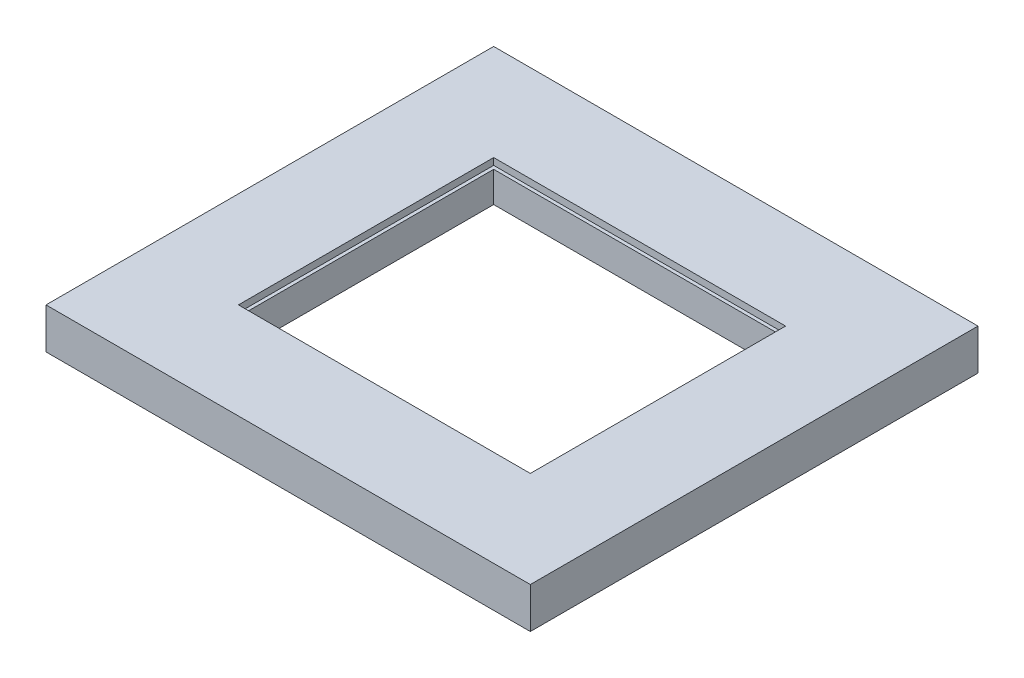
ISO-10303-21;
HEADER;
FILE_DESCRIPTION(('STEP AP214'),'2;1');
FILE_NAME('part.step','',(''),(''),'','','');
FILE_SCHEMA(('AUTOMOTIVE_DESIGN { 1 0 10303 214 1 1 1 1 }'));
ENDSEC;
DATA;
#1=APPLICATION_CONTEXT('core data for automotive mechanical design processes');
#2=APPLICATION_PROTOCOL_DEFINITION('international standard','automotive_design',2000,#1);
#3=PRODUCT_CONTEXT('',#1,'mechanical');
#4=PRODUCT('Part','Part','',(#3));
#5=PRODUCT_RELATED_PRODUCT_CATEGORY('part','',(#4));
#6=PRODUCT_DEFINITION_FORMATION('','',#4);
#7=PRODUCT_DEFINITION_CONTEXT('part definition',#1,'design');
#8=PRODUCT_DEFINITION('design','',#6,#7);
#9=PRODUCT_DEFINITION_SHAPE('','',#8);
#10=(LENGTH_UNIT() NAMED_UNIT(*) SI_UNIT(.MILLI.,.METRE.));
#11=(NAMED_UNIT(*) PLANE_ANGLE_UNIT() SI_UNIT($,.RADIAN.));
#12=(NAMED_UNIT(*) SI_UNIT($,.STERADIAN.) SOLID_ANGLE_UNIT());
#13=UNCERTAINTY_MEASURE_WITH_UNIT(LENGTH_MEASURE(1.E-05),#10,'distance_accuracy_value','');
#14=(GEOMETRIC_REPRESENTATION_CONTEXT(3) GLOBAL_UNCERTAINTY_ASSIGNED_CONTEXT((#13)) GLOBAL_UNIT_ASSIGNED_CONTEXT((#10,
#11,#12)) REPRESENTATION_CONTEXT('',''));
#15=CARTESIAN_POINT('',(0.,0.,0.));
#16=DIRECTION('',(0.,0.,1.));
#17=DIRECTION('',(1.,0.,0.));
#18=AXIS2_PLACEMENT_3D('',#15,#16,#17);
#19=CARTESIAN_POINT('',(0.,7.145,0.));
#20=DIRECTION('',(0.,1.,0.));
#21=DIRECTION('',(0.,0.,1.));
#22=AXIS2_PLACEMENT_3D('',#19,#20,#21);
#23=PLANE('',#22);
#24=DIRECTION('',(-1.,0.,0.));
#25=VECTOR('',#24,1.);
#26=CARTESIAN_POINT('',(-68.2650000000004,7.145,-59.6900000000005));
#27=LINE('',#26,#25);
#28=CARTESIAN_POINT('',(68.2649999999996,7.145,-59.6900000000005));
#29=VERTEX_POINT('',#28);
#30=CARTESIAN_POINT('',(-68.2650000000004,7.145,-59.6900000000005));
#31=VERTEX_POINT('',#30);
#32=EDGE_CURVE('E238',#29,#31,#27,.T.);
#33=ORIENTED_EDGE('',*,*,#32,.F.);
#34=DIRECTION('',(0.,0.,-1.));
#35=VECTOR('',#34,1.);
#36=CARTESIAN_POINT('',(68.2649999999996,7.145,-59.6900000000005));
#37=LINE('',#36,#35);
#38=CARTESIAN_POINT('',(68.2649999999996,7.145,59.6899999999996));
#39=VERTEX_POINT('',#38);
#40=EDGE_CURVE('E236',#39,#29,#37,.T.);
#41=ORIENTED_EDGE('',*,*,#40,.F.);
#42=DIRECTION('',(1.,0.,0.));
#43=VECTOR('',#42,1.);
#44=CARTESIAN_POINT('',(-68.2650000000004,7.145,59.6899999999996));
#45=LINE('',#44,#43);
#46=CARTESIAN_POINT('',(-68.2650000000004,7.145,59.6899999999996));
#47=VERTEX_POINT('',#46);
#48=EDGE_CURVE('E243',#47,#39,#45,.T.);
#49=ORIENTED_EDGE('',*,*,#48,.F.);
#50=DIRECTION('',(0.,0.,1.));
#51=VECTOR('',#50,1.);
#52=CARTESIAN_POINT('',(-68.2650000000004,7.145,-59.6900000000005));
#53=LINE('',#52,#51);
#54=EDGE_CURVE('E241',#31,#47,#53,.T.);
#55=ORIENTED_EDGE('',*,*,#54,.F.);
#56=EDGE_LOOP('',(#33,#41,#49,#55));
#57=FACE_BOUND('',#56,.T.);
#58=DIRECTION('',(1.,0.,0.));
#59=VECTOR('',#58,1.);
#60=CARTESIAN_POINT('',(93.6649999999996,7.145,85.0899999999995));
#61=LINE('',#60,#59);
#62=CARTESIAN_POINT('',(-93.6650000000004,7.145,85.0899999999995));
#63=VERTEX_POINT('',#62);
#64=CARTESIAN_POINT('',(93.6649999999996,7.145,85.0899999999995));
#65=VERTEX_POINT('',#64);
#66=EDGE_CURVE('E209',#63,#65,#61,.T.);
#67=ORIENTED_EDGE('',*,*,#66,.T.);
#68=DIRECTION('',(0.,0.,-1.));
#69=VECTOR('',#68,1.);
#70=CARTESIAN_POINT('',(93.6649999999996,7.145,85.0899999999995));
#71=LINE('',#70,#69);
#72=CARTESIAN_POINT('',(93.6649999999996,7.145,-85.0900000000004));
#73=VERTEX_POINT('',#72);
#74=EDGE_CURVE('E204',#65,#73,#71,.T.);
#75=ORIENTED_EDGE('',*,*,#74,.T.);
#76=DIRECTION('',(-1.,0.,0.));
#77=VECTOR('',#76,1.);
#78=CARTESIAN_POINT('',(93.6649999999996,7.145,-85.0900000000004));
#79=LINE('',#78,#77);
#80=CARTESIAN_POINT('',(-93.6650000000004,7.145,-85.0900000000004));
#81=VERTEX_POINT('',#80);
#82=EDGE_CURVE('E219',#73,#81,#79,.T.);
#83=ORIENTED_EDGE('',*,*,#82,.T.);
#84=DIRECTION('',(0.,0.,1.));
#85=VECTOR('',#84,1.);
#86=CARTESIAN_POINT('',(-93.6650000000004,7.145,85.0899999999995));
#87=LINE('',#86,#85);
#88=EDGE_CURVE('E222',#81,#63,#87,.T.);
#89=ORIENTED_EDGE('',*,*,#88,.T.);
#90=EDGE_LOOP('',(#67,#75,#83,#89));
#91=FACE_BOUND('',#90,.T.);
#92=ADVANCED_FACE('F35',(#57,#91),#23,.T.);
#93=CARTESIAN_POINT('',(0.,-7.145,0.));
#94=DIRECTION('',(0.,1.,0.));
#95=DIRECTION('',(0.,0.,1.));
#96=AXIS2_PLACEMENT_3D('',#93,#94,#95);
#97=PLANE('',#96);
#98=DIRECTION('',(0.,0.,-1.));
#99=VECTOR('',#98,1.);
#100=CARTESIAN_POINT('',(113.265,-7.145,-104.69));
#101=LINE('',#100,#99);
#102=CARTESIAN_POINT('',(113.265,-7.145,104.69));
#103=VERTEX_POINT('',#102);
#104=CARTESIAN_POINT('',(113.265,-7.145,-104.69));
#105=VERTEX_POINT('',#104);
#106=EDGE_CURVE('E264',#103,#105,#101,.T.);
#107=ORIENTED_EDGE('',*,*,#106,.F.);
#108=DIRECTION('',(1.,0.,0.));
#109=VECTOR('',#108,1.);
#110=CARTESIAN_POINT('',(-113.265,-7.145,104.69));
#111=LINE('',#110,#109);
#112=CARTESIAN_POINT('',(-113.265,-7.145,104.69));
#113=VERTEX_POINT('',#112);
#114=EDGE_CURVE('E271',#113,#103,#111,.T.);
#115=ORIENTED_EDGE('',*,*,#114,.F.);
#116=DIRECTION('',(0.,0.,1.));
#117=VECTOR('',#116,1.);
#118=CARTESIAN_POINT('',(-113.265,-7.145,-104.69));
#119=LINE('',#118,#117);
#120=CARTESIAN_POINT('',(-113.265,-7.145,-104.69));
#121=VERTEX_POINT('',#120);
#122=EDGE_CURVE('E269',#121,#113,#119,.T.);
#123=ORIENTED_EDGE('',*,*,#122,.F.);
#124=DIRECTION('',(-1.,0.,0.));
#125=VECTOR('',#124,1.);
#126=CARTESIAN_POINT('',(-113.265,-7.145,-104.69));
#127=LINE('',#126,#125);
#128=EDGE_CURVE('E267',#105,#121,#127,.T.);
#129=ORIENTED_EDGE('',*,*,#128,.F.);
#130=EDGE_LOOP('',(#107,#115,#123,#129));
#131=FACE_BOUND('',#130,.T.);
#132=DIRECTION('',(0.,0.,-1.));
#133=VECTOR('',#132,1.);
#134=CARTESIAN_POINT('',(68.2649999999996,-7.145,-59.6900000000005));
#135=LINE('',#134,#133);
#136=CARTESIAN_POINT('',(68.2649999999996,-7.145,59.6899999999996));
#137=VERTEX_POINT('',#136);
#138=CARTESIAN_POINT('',(68.2649999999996,-7.145,-59.6900000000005));
#139=VERTEX_POINT('',#138);
#140=EDGE_CURVE('E235',#137,#139,#135,.T.);
#141=ORIENTED_EDGE('',*,*,#140,.T.);
#142=DIRECTION('',(-1.,0.,0.));
#143=VECTOR('',#142,1.);
#144=CARTESIAN_POINT('',(-68.2650000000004,-7.145,-59.6900000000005));
#145=LINE('',#144,#143);
#146=CARTESIAN_POINT('',(-68.2650000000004,-7.145,-59.6900000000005));
#147=VERTEX_POINT('',#146);
#148=EDGE_CURVE('E248',#139,#147,#145,.T.);
#149=ORIENTED_EDGE('',*,*,#148,.T.);
#150=DIRECTION('',(0.,0.,1.));
#151=VECTOR('',#150,1.);
#152=CARTESIAN_POINT('',(-68.2650000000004,-7.145,-59.6900000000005));
#153=LINE('',#152,#151);
#154=CARTESIAN_POINT('',(-68.2650000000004,-7.145,59.6899999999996));
#155=VERTEX_POINT('',#154);
#156=EDGE_CURVE('E251',#147,#155,#153,.T.);
#157=ORIENTED_EDGE('',*,*,#156,.T.);
#158=DIRECTION('',(1.,0.,0.));
#159=VECTOR('',#158,1.);
#160=CARTESIAN_POINT('',(-68.2650000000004,-7.145,59.6899999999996));
#161=LINE('',#160,#159);
#162=EDGE_CURVE('E239',#155,#137,#161,.T.);
#163=ORIENTED_EDGE('',*,*,#162,.T.);
#164=EDGE_LOOP('',(#141,#149,#157,#163));
#165=FACE_BOUND('',#164,.T.);
#166=ADVANCED_FACE('F288',(#131,#165),#97,.F.);
#167=CARTESIAN_POINT('',(113.265,7.145,-104.69));
#168=DIRECTION('',(-1.,0.,0.));
#169=DIRECTION('',(0.,0.,1.));
#170=AXIS2_PLACEMENT_3D('',#167,#168,#169);
#171=PLANE('',#170);
#172=ORIENTED_EDGE('',*,*,#106,.T.);
#173=DIRECTION('',(0.,-1.,0.));
#174=VECTOR('',#173,1.);
#175=CARTESIAN_POINT('',(113.265,7.145,-104.69));
#176=LINE('',#175,#174);
#177=CARTESIAN_POINT('',(113.265,11.905,-104.69));
#178=VERTEX_POINT('',#177);
#179=EDGE_CURVE('E11',#178,#105,#176,.T.);
#180=ORIENTED_EDGE('',*,*,#179,.F.);
#181=DIRECTION('',(0.,0.,-1.));
#182=VECTOR('',#181,1.);
#183=CARTESIAN_POINT('',(113.265,11.905,104.69));
#184=LINE('',#183,#182);
#185=CARTESIAN_POINT('',(113.265,11.905,104.69));
#186=VERTEX_POINT('',#185);
#187=EDGE_CURVE('E198',#186,#178,#184,.T.);
#188=ORIENTED_EDGE('',*,*,#187,.F.);
#189=DIRECTION('',(0.,-1.,0.));
#190=VECTOR('',#189,1.);
#191=CARTESIAN_POINT('',(113.265,7.145,104.69));
#192=LINE('',#191,#190);
#193=EDGE_CURVE('E273',#186,#103,#192,.T.);
#194=ORIENTED_EDGE('',*,*,#193,.T.);
#195=EDGE_LOOP('',(#172,#180,#188,#194));
#196=FACE_BOUND('',#195,.T.);
#197=ADVANCED_FACE('F37',(#196),#171,.F.);
#198=CARTESIAN_POINT('',(-113.265,7.145,-104.69));
#199=DIRECTION('',(0.,0.,1.));
#200=DIRECTION('',(1.,0.,0.));
#201=AXIS2_PLACEMENT_3D('',#198,#199,#200);
#202=PLANE('',#201);
#203=ORIENTED_EDGE('',*,*,#128,.T.);
#204=DIRECTION('',(0.,-1.,0.));
#205=VECTOR('',#204,1.);
#206=CARTESIAN_POINT('',(-113.265,7.145,-104.69));
#207=LINE('',#206,#205);
#208=CARTESIAN_POINT('',(-113.265,11.905,-104.69));
#209=VERTEX_POINT('',#208);
#210=EDGE_CURVE('E43',#209,#121,#207,.T.);
#211=ORIENTED_EDGE('',*,*,#210,.F.);
#212=DIRECTION('',(-1.,0.,0.));
#213=VECTOR('',#212,1.);
#214=CARTESIAN_POINT('',(113.265,11.905,-104.69));
#215=LINE('',#214,#213);
#216=EDGE_CURVE('E201',#178,#209,#215,.T.);
#217=ORIENTED_EDGE('',*,*,#216,.F.);
#218=ORIENTED_EDGE('',*,*,#179,.T.);
#219=EDGE_LOOP('',(#203,#211,#217,#218));
#220=FACE_BOUND('',#219,.T.);
#221=ADVANCED_FACE('F296',(#220),#202,.F.);
#222=CARTESIAN_POINT('',(-113.265,7.145,-104.69));
#223=DIRECTION('',(1.,0.,0.));
#224=DIRECTION('',(0.,0.,-1.));
#225=AXIS2_PLACEMENT_3D('',#222,#223,#224);
#226=PLANE('',#225);
#227=ORIENTED_EDGE('',*,*,#122,.T.);
#228=DIRECTION('',(0.,-1.,0.));
#229=VECTOR('',#228,1.);
#230=CARTESIAN_POINT('',(-113.265,7.145,104.69));
#231=LINE('',#230,#229);
#232=CARTESIAN_POINT('',(-113.265,11.905,104.69));
#233=VERTEX_POINT('',#232);
#234=EDGE_CURVE('E276',#233,#113,#231,.T.);
#235=ORIENTED_EDGE('',*,*,#234,.F.);
#236=DIRECTION('',(0.,0.,1.));
#237=VECTOR('',#236,1.);
#238=CARTESIAN_POINT('',(-113.265,11.905,-104.69));
#239=LINE('',#238,#237);
#240=EDGE_CURVE('E169',#209,#233,#239,.T.);
#241=ORIENTED_EDGE('',*,*,#240,.F.);
#242=ORIENTED_EDGE('',*,*,#210,.T.);
#243=EDGE_LOOP('',(#227,#235,#241,#242));
#244=FACE_BOUND('',#243,.T.);
#245=ADVANCED_FACE('F282',(#244),#226,.F.);
#246=CARTESIAN_POINT('',(-113.265,7.145,104.69));
#247=DIRECTION('',(0.,0.,-1.));
#248=DIRECTION('',(-1.,0.,0.));
#249=AXIS2_PLACEMENT_3D('',#246,#247,#248);
#250=PLANE('',#249);
#251=ORIENTED_EDGE('',*,*,#114,.T.);
#252=ORIENTED_EDGE('',*,*,#193,.F.);
#253=DIRECTION('',(1.,0.,0.));
#254=VECTOR('',#253,1.);
#255=CARTESIAN_POINT('',(-113.265,11.905,104.69));
#256=LINE('',#255,#254);
#257=EDGE_CURVE('E195',#233,#186,#256,.T.);
#258=ORIENTED_EDGE('',*,*,#257,.F.);
#259=ORIENTED_EDGE('',*,*,#234,.T.);
#260=EDGE_LOOP('',(#251,#252,#258,#259));
#261=FACE_BOUND('',#260,.T.);
#262=ADVANCED_FACE('F291',(#261),#250,.F.);
#263=CARTESIAN_POINT('',(68.2649999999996,7.145,-59.6900000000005));
#264=DIRECTION('',(-1.,0.,0.));
#265=DIRECTION('',(0.,0.,1.));
#266=AXIS2_PLACEMENT_3D('',#263,#264,#265);
#267=PLANE('',#266);
#268=ORIENTED_EDGE('',*,*,#140,.F.);
#269=DIRECTION('',(0.,-1.,0.));
#270=VECTOR('',#269,1.);
#271=CARTESIAN_POINT('',(68.2649999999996,7.145,59.6899999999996));
#272=LINE('',#271,#270);
#273=EDGE_CURVE('E245',#39,#137,#272,.T.);
#274=ORIENTED_EDGE('',*,*,#273,.F.);
#275=ORIENTED_EDGE('',*,*,#40,.T.);
#276=DIRECTION('',(0.,-1.,0.));
#277=VECTOR('',#276,1.);
#278=CARTESIAN_POINT('',(68.2649999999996,7.145,-59.6900000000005));
#279=LINE('',#278,#277);
#280=EDGE_CURVE('E261',#29,#139,#279,.T.);
#281=ORIENTED_EDGE('',*,*,#280,.T.);
#282=EDGE_LOOP('',(#268,#274,#275,#281));
#283=FACE_BOUND('',#282,.T.);
#284=ADVANCED_FACE('F315',(#283),#267,.T.);
#285=CARTESIAN_POINT('',(-68.2650000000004,7.145,-59.6900000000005));
#286=DIRECTION('',(0.,0.,1.));
#287=DIRECTION('',(1.,0.,0.));
#288=AXIS2_PLACEMENT_3D('',#285,#286,#287);
#289=PLANE('',#288);
#290=ORIENTED_EDGE('',*,*,#148,.F.);
#291=ORIENTED_EDGE('',*,*,#280,.F.);
#292=ORIENTED_EDGE('',*,*,#32,.T.);
#293=DIRECTION('',(0.,-1.,0.));
#294=VECTOR('',#293,1.);
#295=CARTESIAN_POINT('',(-68.2650000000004,7.145,-59.6900000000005));
#296=LINE('',#295,#294);
#297=EDGE_CURVE('E259',#31,#147,#296,.T.);
#298=ORIENTED_EDGE('',*,*,#297,.T.);
#299=EDGE_LOOP('',(#290,#291,#292,#298));
#300=FACE_BOUND('',#299,.T.);
#301=ADVANCED_FACE('F323',(#300),#289,.T.);
#302=CARTESIAN_POINT('',(-68.2650000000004,7.145,-59.6900000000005));
#303=DIRECTION('',(1.,0.,0.));
#304=DIRECTION('',(0.,0.,-1.));
#305=AXIS2_PLACEMENT_3D('',#302,#303,#304);
#306=PLANE('',#305);
#307=ORIENTED_EDGE('',*,*,#156,.F.);
#308=ORIENTED_EDGE('',*,*,#297,.F.);
#309=ORIENTED_EDGE('',*,*,#54,.T.);
#310=DIRECTION('',(0.,-1.,0.));
#311=VECTOR('',#310,1.);
#312=CARTESIAN_POINT('',(-68.2650000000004,7.145,59.6899999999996));
#313=LINE('',#312,#311);
#314=EDGE_CURVE('E58',#47,#155,#313,.T.);
#315=ORIENTED_EDGE('',*,*,#314,.T.);
#316=EDGE_LOOP('',(#307,#308,#309,#315));
#317=FACE_BOUND('',#316,.T.);
#318=ADVANCED_FACE('F328',(#317),#306,.T.);
#319=CARTESIAN_POINT('',(-68.2650000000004,7.145,59.6899999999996));
#320=DIRECTION('',(0.,0.,-1.));
#321=DIRECTION('',(-1.,0.,0.));
#322=AXIS2_PLACEMENT_3D('',#319,#320,#321);
#323=PLANE('',#322);
#324=ORIENTED_EDGE('',*,*,#162,.F.);
#325=ORIENTED_EDGE('',*,*,#314,.F.);
#326=ORIENTED_EDGE('',*,*,#48,.T.);
#327=ORIENTED_EDGE('',*,*,#273,.T.);
#328=EDGE_LOOP('',(#324,#325,#326,#327));
#329=FACE_BOUND('',#328,.T.);
#330=ADVANCED_FACE('F333',(#329),#323,.T.);
#331=CARTESIAN_POINT('',(93.6649999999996,8.735,85.0899999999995));
#332=DIRECTION('',(-1.,0.,0.));
#333=DIRECTION('',(0.,0.,1.));
#334=AXIS2_PLACEMENT_3D('',#331,#332,#333);
#335=PLANE('',#334);
#336=ORIENTED_EDGE('',*,*,#74,.F.);
#337=DIRECTION('',(0.,-1.,0.));
#338=VECTOR('',#337,1.);
#339=CARTESIAN_POINT('',(93.6649999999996,8.735,85.0899999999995));
#340=LINE('',#339,#338);
#341=CARTESIAN_POINT('',(93.6649999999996,8.735,85.0899999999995));
#342=VERTEX_POINT('',#341);
#343=EDGE_CURVE('E50',#342,#65,#340,.T.);
#344=ORIENTED_EDGE('',*,*,#343,.F.);
#345=DIRECTION('',(0.,0.,-1.));
#346=VECTOR('',#345,1.);
#347=CARTESIAN_POINT('',(93.6649999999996,8.735,85.0899999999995));
#348=LINE('',#347,#346);
#349=CARTESIAN_POINT('',(93.6649999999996,8.735,-85.0900000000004));
#350=VERTEX_POINT('',#349);
#351=EDGE_CURVE('E205',#342,#350,#348,.T.);
#352=ORIENTED_EDGE('',*,*,#351,.T.);
#353=DIRECTION('',(0.,-1.,0.));
#354=VECTOR('',#353,1.);
#355=CARTESIAN_POINT('',(93.6649999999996,8.735,-85.0900000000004));
#356=LINE('',#355,#354);
#357=EDGE_CURVE('E232',#350,#73,#356,.T.);
#358=ORIENTED_EDGE('',*,*,#357,.T.);
#359=EDGE_LOOP('',(#336,#344,#352,#358));
#360=FACE_BOUND('',#359,.T.);
#361=ADVANCED_FACE('F344',(#360),#335,.T.);
#362=CARTESIAN_POINT('',(93.6649999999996,8.735,-85.0900000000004));
#363=DIRECTION('',(0.,0.,1.));
#364=DIRECTION('',(1.,0.,0.));
#365=AXIS2_PLACEMENT_3D('',#362,#363,#364);
#366=PLANE('',#365);
#367=ORIENTED_EDGE('',*,*,#82,.F.);
#368=ORIENTED_EDGE('',*,*,#357,.F.);
#369=DIRECTION('',(-1.,0.,0.));
#370=VECTOR('',#369,1.);
#371=CARTESIAN_POINT('',(93.6649999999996,8.735,-85.0900000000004));
#372=LINE('',#371,#370);
#373=CARTESIAN_POINT('',(-93.6650000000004,8.735,-85.0900000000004));
#374=VERTEX_POINT('',#373);
#375=EDGE_CURVE('E208',#350,#374,#372,.T.);
#376=ORIENTED_EDGE('',*,*,#375,.T.);
#377=DIRECTION('',(0.,-1.,0.));
#378=VECTOR('',#377,1.);
#379=CARTESIAN_POINT('',(-93.6650000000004,8.735,-85.0900000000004));
#380=LINE('',#379,#378);
#381=EDGE_CURVE('E230',#374,#81,#380,.T.);
#382=ORIENTED_EDGE('',*,*,#381,.T.);
#383=EDGE_LOOP('',(#367,#368,#376,#382));
#384=FACE_BOUND('',#383,.T.);
#385=ADVANCED_FACE('F348',(#384),#366,.T.);
#386=CARTESIAN_POINT('',(-93.6650000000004,8.735,85.0899999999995));
#387=DIRECTION('',(1.,0.,0.));
#388=DIRECTION('',(0.,0.,-1.));
#389=AXIS2_PLACEMENT_3D('',#386,#387,#388);
#390=PLANE('',#389);
#391=ORIENTED_EDGE('',*,*,#88,.F.);
#392=ORIENTED_EDGE('',*,*,#381,.F.);
#393=DIRECTION('',(0.,0.,1.));
#394=VECTOR('',#393,1.);
#395=CARTESIAN_POINT('',(-93.6650000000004,8.735,85.0899999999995));
#396=LINE('',#395,#394);
#397=CARTESIAN_POINT('',(-93.6650000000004,8.735,85.0899999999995));
#398=VERTEX_POINT('',#397);
#399=EDGE_CURVE('E212',#374,#398,#396,.T.);
#400=ORIENTED_EDGE('',*,*,#399,.T.);
#401=DIRECTION('',(0.,-1.,0.));
#402=VECTOR('',#401,1.);
#403=CARTESIAN_POINT('',(-93.6650000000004,8.735,85.0899999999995));
#404=LINE('',#403,#402);
#405=EDGE_CURVE('E228',#398,#63,#404,.T.);
#406=ORIENTED_EDGE('',*,*,#405,.T.);
#407=EDGE_LOOP('',(#391,#392,#400,#406));
#408=FACE_BOUND('',#407,.T.);
#409=ADVANCED_FACE('F352',(#408),#390,.T.);
#410=CARTESIAN_POINT('',(93.6649999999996,8.735,85.0899999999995));
#411=DIRECTION('',(0.,0.,-1.));
#412=DIRECTION('',(-1.,0.,0.));
#413=AXIS2_PLACEMENT_3D('',#410,#411,#412);
#414=PLANE('',#413);
#415=ORIENTED_EDGE('',*,*,#66,.F.);
#416=ORIENTED_EDGE('',*,*,#405,.F.);
#417=DIRECTION('',(1.,0.,0.));
#418=VECTOR('',#417,1.);
#419=CARTESIAN_POINT('',(93.6649999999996,8.735,85.0899999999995));
#420=LINE('',#419,#418);
#421=EDGE_CURVE('E215',#398,#342,#420,.T.);
#422=ORIENTED_EDGE('',*,*,#421,.T.);
#423=ORIENTED_EDGE('',*,*,#343,.T.);
#424=EDGE_LOOP('',(#415,#416,#422,#423));
#425=FACE_BOUND('',#424,.T.);
#426=ADVANCED_FACE('F356',(#425),#414,.T.);
#427=CARTESIAN_POINT('',(0.,11.905,0.));
#428=DIRECTION('',(0.,1.,0.));
#429=DIRECTION('',(0.,0.,1.));
#430=AXIS2_PLACEMENT_3D('',#427,#428,#429);
#431=PLANE('',#430);
#432=ORIENTED_EDGE('',*,*,#240,.T.);
#433=ORIENTED_EDGE('',*,*,#257,.T.);
#434=ORIENTED_EDGE('',*,*,#187,.T.);
#435=ORIENTED_EDGE('',*,*,#216,.T.);
#436=EDGE_LOOP('',(#432,#433,#434,#435));
#437=FACE_BOUND('',#436,.T.);
#438=DIRECTION('',(1.,0.,0.));
#439=VECTOR('',#438,1.);
#440=CARTESIAN_POINT('',(-68.2650000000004,11.905,59.6899999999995));
#441=LINE('',#440,#439);
#442=CARTESIAN_POINT('',(-68.2650000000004,11.905,59.6899999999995));
#443=VERTEX_POINT('',#442);
#444=CARTESIAN_POINT('',(68.2649999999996,11.905,59.6899999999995));
#445=VERTEX_POINT('',#444);
#446=EDGE_CURVE('E161',#443,#445,#441,.T.);
#447=ORIENTED_EDGE('',*,*,#446,.F.);
#448=DIRECTION('',(0.,0.,1.));
#449=VECTOR('',#448,1.);
#450=CARTESIAN_POINT('',(-68.2650000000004,11.905,-59.6900000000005));
#451=LINE('',#450,#449);
#452=CARTESIAN_POINT('',(-68.2650000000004,11.905,-59.6900000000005));
#453=VERTEX_POINT('',#452);
#454=EDGE_CURVE('E151',#453,#443,#451,.T.);
#455=ORIENTED_EDGE('',*,*,#454,.F.);
#456=DIRECTION('',(-1.,0.,0.));
#457=VECTOR('',#456,1.);
#458=CARTESIAN_POINT('',(68.2649999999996,11.905,-59.6900000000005));
#459=LINE('',#458,#457);
#460=CARTESIAN_POINT('',(68.2649999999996,11.905,-59.6900000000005));
#461=VERTEX_POINT('',#460);
#462=EDGE_CURVE('E177',#461,#453,#459,.T.);
#463=ORIENTED_EDGE('',*,*,#462,.F.);
#464=DIRECTION('',(0.,0.,-1.));
#465=VECTOR('',#464,1.);
#466=CARTESIAN_POINT('',(68.2649999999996,11.905,59.6899999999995));
#467=LINE('',#466,#465);
#468=EDGE_CURVE('E175',#445,#461,#467,.T.);
#469=ORIENTED_EDGE('',*,*,#468,.F.);
#470=EDGE_LOOP('',(#447,#455,#463,#469));
#471=FACE_BOUND('',#470,.T.);
#472=ADVANCED_FACE('F173',(#437,#471),#431,.T.);
#473=CARTESIAN_POINT('',(0.,8.735,0.));
#474=DIRECTION('',(0.,1.,0.));
#475=DIRECTION('',(0.,0.,1.));
#476=AXIS2_PLACEMENT_3D('',#473,#474,#475);
#477=PLANE('',#476);
#478=ORIENTED_EDGE('',*,*,#375,.F.);
#479=ORIENTED_EDGE('',*,*,#351,.F.);
#480=ORIENTED_EDGE('',*,*,#421,.F.);
#481=ORIENTED_EDGE('',*,*,#399,.F.);
#482=EDGE_LOOP('',(#478,#479,#480,#481));
#483=FACE_BOUND('',#482,.T.);
#484=DIRECTION('',(0.,0.,1.));
#485=VECTOR('',#484,1.);
#486=CARTESIAN_POINT('',(-68.2650000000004,8.735,-59.6900000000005));
#487=LINE('',#486,#485);
#488=CARTESIAN_POINT('',(-68.2650000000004,8.735,-59.6900000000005));
#489=VERTEX_POINT('',#488);
#490=CARTESIAN_POINT('',(-68.2650000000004,8.735,59.6899999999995));
#491=VERTEX_POINT('',#490);
#492=EDGE_CURVE('E181',#489,#491,#487,.T.);
#493=ORIENTED_EDGE('',*,*,#492,.T.);
#494=DIRECTION('',(1.,0.,0.));
#495=VECTOR('',#494,1.);
#496=CARTESIAN_POINT('',(-68.2650000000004,8.735,59.6899999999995));
#497=LINE('',#496,#495);
#498=CARTESIAN_POINT('',(68.2649999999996,8.735,59.6899999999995));
#499=VERTEX_POINT('',#498);
#500=EDGE_CURVE('E168',#491,#499,#497,.T.);
#501=ORIENTED_EDGE('',*,*,#500,.T.);
#502=DIRECTION('',(0.,0.,-1.));
#503=VECTOR('',#502,1.);
#504=CARTESIAN_POINT('',(68.2649999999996,8.735,59.6899999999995));
#505=LINE('',#504,#503);
#506=CARTESIAN_POINT('',(68.2649999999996,8.735,-59.6900000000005));
#507=VERTEX_POINT('',#506);
#508=EDGE_CURVE('E184',#499,#507,#505,.T.);
#509=ORIENTED_EDGE('',*,*,#508,.T.);
#510=DIRECTION('',(-1.,0.,0.));
#511=VECTOR('',#510,1.);
#512=CARTESIAN_POINT('',(68.2649999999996,8.735,-59.6900000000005));
#513=LINE('',#512,#511);
#514=EDGE_CURVE('E162',#507,#489,#513,.T.);
#515=ORIENTED_EDGE('',*,*,#514,.T.);
#516=EDGE_LOOP('',(#493,#501,#509,#515));
#517=FACE_BOUND('',#516,.T.);
#518=ADVANCED_FACE('F360',(#483,#517),#477,.F.);
#519=CARTESIAN_POINT('',(-68.2650000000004,11.905,-59.6900000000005));
#520=DIRECTION('',(1.,0.,0.));
#521=DIRECTION('',(0.,0.,-1.));
#522=AXIS2_PLACEMENT_3D('',#519,#520,#521);
#523=PLANE('',#522);
#524=ORIENTED_EDGE('',*,*,#492,.F.);
#525=DIRECTION('',(0.,-1.,0.));
#526=VECTOR('',#525,1.);
#527=CARTESIAN_POINT('',(-68.2650000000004,11.905,-59.6900000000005));
#528=LINE('',#527,#526);
#529=EDGE_CURVE('E157',#453,#489,#528,.T.);
#530=ORIENTED_EDGE('',*,*,#529,.F.);
#531=ORIENTED_EDGE('',*,*,#454,.T.);
#532=DIRECTION('',(0.,-1.,0.));
#533=VECTOR('',#532,1.);
#534=CARTESIAN_POINT('',(-68.2650000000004,11.905,59.6899999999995));
#535=LINE('',#534,#533);
#536=EDGE_CURVE('E154',#443,#491,#535,.T.);
#537=ORIENTED_EDGE('',*,*,#536,.T.);
#538=EDGE_LOOP('',(#524,#530,#531,#537));
#539=FACE_BOUND('',#538,.T.);
#540=ADVANCED_FACE('F153',(#539),#523,.T.);
#541=CARTESIAN_POINT('',(-68.2650000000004,11.905,59.6899999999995));
#542=DIRECTION('',(0.,0.,-1.));
#543=DIRECTION('',(-1.,0.,0.));
#544=AXIS2_PLACEMENT_3D('',#541,#542,#543);
#545=PLANE('',#544);
#546=ORIENTED_EDGE('',*,*,#500,.F.);
#547=ORIENTED_EDGE('',*,*,#536,.F.);
#548=ORIENTED_EDGE('',*,*,#446,.T.);
#549=DIRECTION('',(0.,-1.,0.));
#550=VECTOR('',#549,1.);
#551=CARTESIAN_POINT('',(68.2649999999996,11.905,59.6899999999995));
#552=LINE('',#551,#550);
#553=EDGE_CURVE('E170',#445,#499,#552,.T.);
#554=ORIENTED_EDGE('',*,*,#553,.T.);
#555=EDGE_LOOP('',(#546,#547,#548,#554));
#556=FACE_BOUND('',#555,.T.);
#557=ADVANCED_FACE('F165',(#556),#545,.T.);
#558=CARTESIAN_POINT('',(68.2649999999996,11.905,59.6899999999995));
#559=DIRECTION('',(-1.,0.,0.));
#560=DIRECTION('',(0.,0.,1.));
#561=AXIS2_PLACEMENT_3D('',#558,#559,#560);
#562=PLANE('',#561);
#563=ORIENTED_EDGE('',*,*,#508,.F.);
#564=ORIENTED_EDGE('',*,*,#553,.F.);
#565=ORIENTED_EDGE('',*,*,#468,.T.);
#566=DIRECTION('',(0.,-1.,0.));
#567=VECTOR('',#566,1.);
#568=CARTESIAN_POINT('',(68.2649999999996,11.905,-59.6900000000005));
#569=LINE('',#568,#567);
#570=EDGE_CURVE('E190',#461,#507,#569,.T.);
#571=ORIENTED_EDGE('',*,*,#570,.T.);
#572=EDGE_LOOP('',(#563,#564,#565,#571));
#573=FACE_BOUND('',#572,.T.);
#574=ADVANCED_FACE('F370',(#573),#562,.T.);
#575=CARTESIAN_POINT('',(68.2649999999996,11.905,-59.6900000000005));
#576=DIRECTION('',(0.,0.,1.));
#577=DIRECTION('',(1.,0.,0.));
#578=AXIS2_PLACEMENT_3D('',#575,#576,#577);
#579=PLANE('',#578);
#580=ORIENTED_EDGE('',*,*,#514,.F.);
#581=ORIENTED_EDGE('',*,*,#570,.F.);
#582=ORIENTED_EDGE('',*,*,#462,.T.);
#583=ORIENTED_EDGE('',*,*,#529,.T.);
#584=EDGE_LOOP('',(#580,#581,#582,#583));
#585=FACE_BOUND('',#584,.T.);
#586=ADVANCED_FACE('F373',(#585),#579,.T.);
#587=CLOSED_SHELL('',(#92,#166,#197,#221,#245,#262,#284,#301,#318,#330,#361,#385,#409,#426,#472,
#518,#540,#557,#574,#586));
#588=MANIFOLD_SOLID_BREP('B2',#587);
#589=ADVANCED_BREP_SHAPE_REPRESENTATION('',(#18,#588),#14);
#590=SHAPE_DEFINITION_REPRESENTATION(#9,#589);
ENDSEC;
END-ISO-10303-21;
